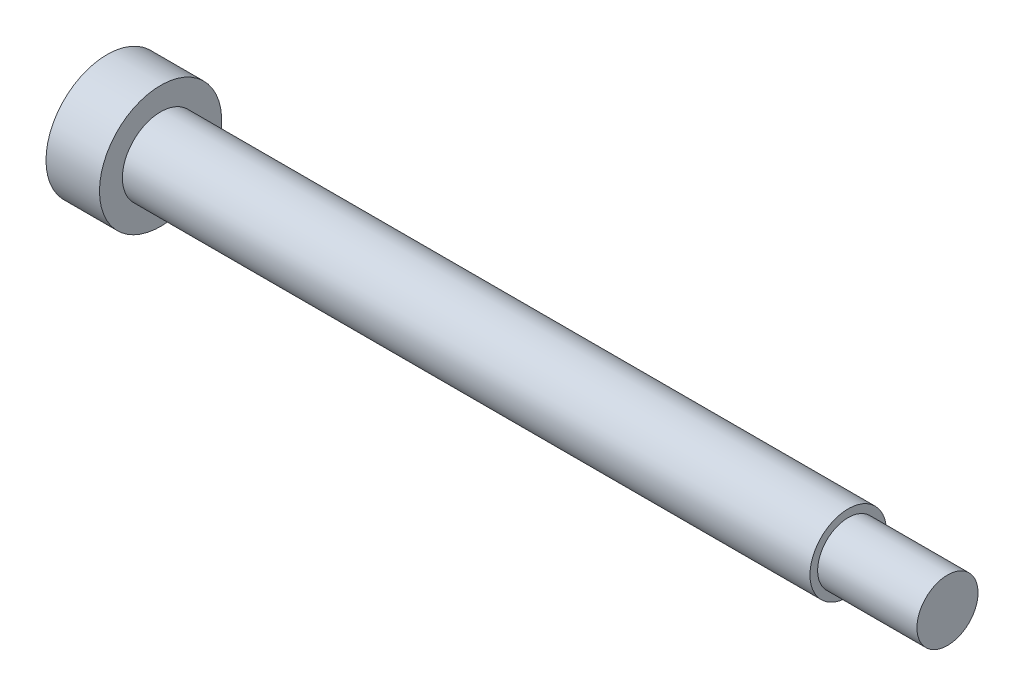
ISO-10303-21;
HEADER;
FILE_DESCRIPTION(('STEP AP214'),'2;1');
FILE_NAME('part.step','',(''),(''),'','','');
FILE_SCHEMA(('AUTOMOTIVE_DESIGN { 1 0 10303 214 1 1 1 1 }'));
ENDSEC;
DATA;
#1=APPLICATION_CONTEXT('core data for automotive mechanical design processes');
#2=APPLICATION_PROTOCOL_DEFINITION('international standard','automotive_design',2000,#1);
#3=PRODUCT_CONTEXT('',#1,'mechanical');
#4=PRODUCT('Part','Part','',(#3));
#5=PRODUCT_RELATED_PRODUCT_CATEGORY('part','',(#4));
#6=PRODUCT_DEFINITION_FORMATION('','',#4);
#7=PRODUCT_DEFINITION_CONTEXT('part definition',#1,'design');
#8=PRODUCT_DEFINITION('design','',#6,#7);
#9=PRODUCT_DEFINITION_SHAPE('','',#8);
#10=(LENGTH_UNIT() NAMED_UNIT(*) SI_UNIT(.MILLI.,.METRE.));
#11=(NAMED_UNIT(*) PLANE_ANGLE_UNIT() SI_UNIT($,.RADIAN.));
#12=(NAMED_UNIT(*) SI_UNIT($,.STERADIAN.) SOLID_ANGLE_UNIT());
#13=UNCERTAINTY_MEASURE_WITH_UNIT(LENGTH_MEASURE(1.E-05),#10,'distance_accuracy_value','');
#14=(GEOMETRIC_REPRESENTATION_CONTEXT(3) GLOBAL_UNCERTAINTY_ASSIGNED_CONTEXT((#13)) GLOBAL_UNIT_ASSIGNED_CONTEXT((#10,
#11,#12)) REPRESENTATION_CONTEXT('',''));
#15=CARTESIAN_POINT('',(0.,0.,0.));
#16=DIRECTION('',(0.,0.,1.));
#17=DIRECTION('',(1.,0.,0.));
#18=AXIS2_PLACEMENT_3D('',#15,#16,#17);
#19=CARTESIAN_POINT('',(0.,0.,0.));
#20=DIRECTION('',(1.,0.,0.));
#21=DIRECTION('',(0.,0.,-1.));
#22=AXIS2_PLACEMENT_3D('',#19,#20,#21);
#23=PLANE('',#22);
#24=DIRECTION('',(0.,0.866025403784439,-0.5));
#25=VECTOR('',#24,1.);
#26=CARTESIAN_POINT('',(0.,0.,2.5));
#27=LINE('',#26,#25);
#28=CARTESIAN_POINT('',(0.,0.,2.5));
#29=VERTEX_POINT('',#28);
#30=CARTESIAN_POINT('',(0.,2.1650635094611,1.25));
#31=VERTEX_POINT('',#30);
#32=EDGE_CURVE('E104',#29,#31,#27,.T.);
#33=ORIENTED_EDGE('',*,*,#32,.F.);
#34=DIRECTION('',(0.,0.866025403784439,0.5));
#35=VECTOR('',#34,1.);
#36=CARTESIAN_POINT('',(0.,-2.1650635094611,1.25));
#37=LINE('',#36,#35);
#38=CARTESIAN_POINT('',(0.,-2.1650635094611,1.25));
#39=VERTEX_POINT('',#38);
#40=EDGE_CURVE('E30',#39,#29,#37,.T.);
#41=ORIENTED_EDGE('',*,*,#40,.F.);
#42=DIRECTION('',(0.,0.,1.));
#43=VECTOR('',#42,1.);
#44=CARTESIAN_POINT('',(0.,-2.1650635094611,-1.25));
#45=LINE('',#44,#43);
#46=CARTESIAN_POINT('',(0.,-2.1650635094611,-1.25));
#47=VERTEX_POINT('',#46);
#48=EDGE_CURVE('E113',#47,#39,#45,.T.);
#49=ORIENTED_EDGE('',*,*,#48,.F.);
#50=DIRECTION('',(0.,-0.866025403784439,0.5));
#51=VECTOR('',#50,1.);
#52=CARTESIAN_POINT('',(0.,0.,-2.5));
#53=LINE('',#52,#51);
#54=CARTESIAN_POINT('',(0.,0.,-2.5));
#55=VERTEX_POINT('',#54);
#56=EDGE_CURVE('E111',#55,#47,#53,.T.);
#57=ORIENTED_EDGE('',*,*,#56,.F.);
#58=DIRECTION('',(0.,-0.866025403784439,-0.5));
#59=VECTOR('',#58,1.);
#60=CARTESIAN_POINT('',(0.,2.1650635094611,-1.25));
#61=LINE('',#60,#59);
#62=CARTESIAN_POINT('',(0.,2.1650635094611,-1.25));
#63=VERTEX_POINT('',#62);
#64=EDGE_CURVE('E78',#63,#55,#61,.T.);
#65=ORIENTED_EDGE('',*,*,#64,.F.);
#66=DIRECTION('',(0.,0.,-1.));
#67=VECTOR('',#66,1.);
#68=CARTESIAN_POINT('',(0.,2.1650635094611,1.25));
#69=LINE('',#68,#67);
#70=EDGE_CURVE('E107',#31,#63,#69,.T.);
#71=ORIENTED_EDGE('',*,*,#70,.F.);
#72=EDGE_LOOP('',(#33,#41,#49,#57,#65,#71));
#73=FACE_BOUND('',#72,.T.);
#74=CARTESIAN_POINT('',(0.,0.,0.));
#75=DIRECTION('',(-1.,0.,0.));
#76=DIRECTION('',(0.,0.,1.));
#77=AXIS2_PLACEMENT_3D('',#74,#75,#76);
#78=CIRCLE('',#77,8.);
#79=CARTESIAN_POINT('',(0.,0.,8.));
#80=VERTEX_POINT('',#79);
#81=EDGE_CURVE('E10',#80,#80,#78,.T.);
#82=ORIENTED_EDGE('',*,*,#81,.T.);
#83=EDGE_LOOP('',(#82));
#84=FACE_BOUND('',#83,.T.);
#85=ADVANCED_FACE('F16',(#73,#84),#23,.F.);
#86=CARTESIAN_POINT('',(0.,0.,0.));
#87=DIRECTION('',(-1.,0.,0.));
#88=DIRECTION('',(0.,0.,1.));
#89=AXIS2_PLACEMENT_3D('',#86,#87,#88);
#90=CYLINDRICAL_SURFACE('',#89,8.);
#91=ORIENTED_EDGE('',*,*,#81,.F.);
#92=EDGE_LOOP('',(#91));
#93=FACE_BOUND('',#92,.T.);
#94=CARTESIAN_POINT('',(7.,0.,0.));
#95=DIRECTION('',(-1.,0.,0.));
#96=DIRECTION('',(0.,0.,1.));
#97=AXIS2_PLACEMENT_3D('',#94,#95,#96);
#98=CIRCLE('',#97,8.);
#99=CARTESIAN_POINT('',(7.,0.,8.));
#100=VERTEX_POINT('',#99);
#101=EDGE_CURVE('E23',#100,#100,#98,.T.);
#102=ORIENTED_EDGE('',*,*,#101,.T.);
#103=EDGE_LOOP('',(#102));
#104=FACE_BOUND('',#103,.T.);
#105=ADVANCED_FACE('F136',(#93,#104),#90,.T.);
#106=CARTESIAN_POINT('',(7.,8.,0.));
#107=DIRECTION('',(-1.,0.,0.));
#108=DIRECTION('',(0.,0.,1.));
#109=AXIS2_PLACEMENT_3D('',#106,#107,#108);
#110=PLANE('',#109);
#111=ORIENTED_EDGE('',*,*,#101,.F.);
#112=EDGE_LOOP('',(#111));
#113=FACE_BOUND('',#112,.T.);
#114=CARTESIAN_POINT('',(7.,0.,0.));
#115=DIRECTION('',(-1.,0.,0.));
#116=DIRECTION('',(0.,0.,1.));
#117=AXIS2_PLACEMENT_3D('',#114,#115,#116);
#118=CIRCLE('',#117,5.);
#119=CARTESIAN_POINT('',(7.,0.,5.));
#120=VERTEX_POINT('',#119);
#121=EDGE_CURVE('E131',#120,#120,#118,.T.);
#122=ORIENTED_EDGE('',*,*,#121,.T.);
#123=EDGE_LOOP('',(#122));
#124=FACE_BOUND('',#123,.T.);
#125=ADVANCED_FACE('F138',(#113,#124),#110,.F.);
#126=CARTESIAN_POINT('',(0.,0.,0.));
#127=DIRECTION('',(-1.,0.,0.));
#128=DIRECTION('',(0.,0.,1.));
#129=AXIS2_PLACEMENT_3D('',#126,#127,#128);
#130=CYLINDRICAL_SURFACE('',#129,5.);
#131=ORIENTED_EDGE('',*,*,#121,.F.);
#132=EDGE_LOOP('',(#131));
#133=FACE_BOUND('',#132,.T.);
#134=CARTESIAN_POINT('',(97.,0.,0.));
#135=DIRECTION('',(-1.,0.,0.));
#136=DIRECTION('',(0.,0.,1.));
#137=AXIS2_PLACEMENT_3D('',#134,#135,#136);
#138=CIRCLE('',#137,5.);
#139=CARTESIAN_POINT('',(97.,0.,5.));
#140=VERTEX_POINT('',#139);
#141=EDGE_CURVE('E128',#140,#140,#138,.T.);
#142=ORIENTED_EDGE('',*,*,#141,.T.);
#143=EDGE_LOOP('',(#142));
#144=FACE_BOUND('',#143,.T.);
#145=ADVANCED_FACE('F141',(#133,#144),#130,.T.);
#146=CARTESIAN_POINT('',(97.,5.,0.));
#147=DIRECTION('',(-1.,0.,0.));
#148=DIRECTION('',(0.,0.,1.));
#149=AXIS2_PLACEMENT_3D('',#146,#147,#148);
#150=PLANE('',#149);
#151=ORIENTED_EDGE('',*,*,#141,.F.);
#152=EDGE_LOOP('',(#151));
#153=FACE_BOUND('',#152,.T.);
#154=CARTESIAN_POINT('',(97.,0.,0.));
#155=DIRECTION('',(-1.,0.,0.));
#156=DIRECTION('',(0.,0.,1.));
#157=AXIS2_PLACEMENT_3D('',#154,#155,#156);
#158=CIRCLE('',#157,4.);
#159=CARTESIAN_POINT('',(97.,0.,4.));
#160=VERTEX_POINT('',#159);
#161=EDGE_CURVE('E125',#160,#160,#158,.T.);
#162=ORIENTED_EDGE('',*,*,#161,.T.);
#163=EDGE_LOOP('',(#162));
#164=FACE_BOUND('',#163,.T.);
#165=ADVANCED_FACE('F147',(#153,#164),#150,.F.);
#166=CARTESIAN_POINT('',(0.,0.,0.));
#167=DIRECTION('',(-1.,0.,0.));
#168=DIRECTION('',(0.,0.,1.));
#169=AXIS2_PLACEMENT_3D('',#166,#167,#168);
#170=CYLINDRICAL_SURFACE('',#169,4.);
#171=ORIENTED_EDGE('',*,*,#161,.F.);
#172=EDGE_LOOP('',(#171));
#173=FACE_BOUND('',#172,.T.);
#174=CARTESIAN_POINT('',(110.,0.,0.));
#175=DIRECTION('',(-1.,0.,0.));
#176=DIRECTION('',(0.,0.,1.));
#177=AXIS2_PLACEMENT_3D('',#174,#175,#176);
#178=CIRCLE('',#177,4.);
#179=CARTESIAN_POINT('',(110.,0.,4.));
#180=VERTEX_POINT('',#179);
#181=EDGE_CURVE('E117',#180,#180,#178,.T.);
#182=ORIENTED_EDGE('',*,*,#181,.T.);
#183=EDGE_LOOP('',(#182));
#184=FACE_BOUND('',#183,.T.);
#185=ADVANCED_FACE('F153',(#173,#184),#170,.T.);
#186=CARTESIAN_POINT('',(110.,4.,0.));
#187=DIRECTION('',(-1.,0.,0.));
#188=DIRECTION('',(0.,0.,1.));
#189=AXIS2_PLACEMENT_3D('',#186,#187,#188);
#190=PLANE('',#189);
#191=ORIENTED_EDGE('',*,*,#181,.F.);
#192=EDGE_LOOP('',(#191));
#193=FACE_BOUND('',#192,.T.);
#194=ADVANCED_FACE('F159',(#193),#190,.F.);
#195=CARTESIAN_POINT('',(5.,-2.1650635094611,1.25));
#196=DIRECTION('',(0.,-0.5,0.866025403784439));
#197=DIRECTION('',(0.,-0.866025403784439,-0.5));
#198=AXIS2_PLACEMENT_3D('',#195,#196,#197);
#199=PLANE('',#198);
#200=ORIENTED_EDGE('',*,*,#40,.T.);
#201=DIRECTION('',(-1.,0.,0.));
#202=VECTOR('',#201,1.);
#203=CARTESIAN_POINT('',(5.,0.,2.5));
#204=LINE('',#203,#202);
#205=CARTESIAN_POINT('',(5.,0.,2.5));
#206=VERTEX_POINT('',#205);
#207=EDGE_CURVE('E60',#206,#29,#204,.T.);
#208=ORIENTED_EDGE('',*,*,#207,.F.);
#209=DIRECTION('',(0.,0.866025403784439,0.5));
#210=VECTOR('',#209,1.);
#211=CARTESIAN_POINT('',(5.,-2.1650635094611,1.25));
#212=LINE('',#211,#210);
#213=CARTESIAN_POINT('',(5.,-2.1650635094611,1.25));
#214=VERTEX_POINT('',#213);
#215=EDGE_CURVE('E115',#214,#206,#212,.T.);
#216=ORIENTED_EDGE('',*,*,#215,.F.);
#217=DIRECTION('',(-1.,0.,0.));
#218=VECTOR('',#217,1.);
#219=CARTESIAN_POINT('',(5.,-2.1650635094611,1.25));
#220=LINE('',#219,#218);
#221=EDGE_CURVE('E38',#214,#39,#220,.T.);
#222=ORIENTED_EDGE('',*,*,#221,.T.);
#223=EDGE_LOOP('',(#200,#208,#216,#222));
#224=FACE_BOUND('',#223,.T.);
#225=ADVANCED_FACE('F164',(#224),#199,.F.);
#226=CARTESIAN_POINT('',(5.,-2.1650635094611,-1.25));
#227=DIRECTION('',(0.,-1.,0.));
#228=DIRECTION('',(0.,0.,-1.));
#229=AXIS2_PLACEMENT_3D('',#226,#227,#228);
#230=PLANE('',#229);
#231=ORIENTED_EDGE('',*,*,#48,.T.);
#232=ORIENTED_EDGE('',*,*,#221,.F.);
#233=DIRECTION('',(0.,0.,1.));
#234=VECTOR('',#233,1.);
#235=CARTESIAN_POINT('',(5.,-2.1650635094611,-1.25));
#236=LINE('',#235,#234);
#237=CARTESIAN_POINT('',(5.,-2.1650635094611,-1.25));
#238=VERTEX_POINT('',#237);
#239=EDGE_CURVE('E90',#238,#214,#236,.T.);
#240=ORIENTED_EDGE('',*,*,#239,.F.);
#241=DIRECTION('',(-1.,0.,0.));
#242=VECTOR('',#241,1.);
#243=CARTESIAN_POINT('',(5.,-2.1650635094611,-1.25));
#244=LINE('',#243,#242);
#245=EDGE_CURVE('E82',#238,#47,#244,.T.);
#246=ORIENTED_EDGE('',*,*,#245,.T.);
#247=EDGE_LOOP('',(#231,#232,#240,#246));
#248=FACE_BOUND('',#247,.T.);
#249=ADVANCED_FACE('F171',(#248),#230,.F.);
#250=CARTESIAN_POINT('',(5.,0.,-2.5));
#251=DIRECTION('',(0.,-0.5,-0.866025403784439));
#252=DIRECTION('',(0.,0.866025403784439,-0.5));
#253=AXIS2_PLACEMENT_3D('',#250,#251,#252);
#254=PLANE('',#253);
#255=ORIENTED_EDGE('',*,*,#56,.T.);
#256=ORIENTED_EDGE('',*,*,#245,.F.);
#257=DIRECTION('',(0.,-0.866025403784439,0.5));
#258=VECTOR('',#257,1.);
#259=CARTESIAN_POINT('',(5.,0.,-2.5));
#260=LINE('',#259,#258);
#261=CARTESIAN_POINT('',(5.,0.,-2.5));
#262=VERTEX_POINT('',#261);
#263=EDGE_CURVE('E86',#262,#238,#260,.T.);
#264=ORIENTED_EDGE('',*,*,#263,.F.);
#265=DIRECTION('',(-1.,0.,0.));
#266=VECTOR('',#265,1.);
#267=CARTESIAN_POINT('',(5.,0.,-2.5));
#268=LINE('',#267,#266);
#269=EDGE_CURVE('E71',#262,#55,#268,.T.);
#270=ORIENTED_EDGE('',*,*,#269,.T.);
#271=EDGE_LOOP('',(#255,#256,#264,#270));
#272=FACE_BOUND('',#271,.T.);
#273=ADVANCED_FACE('F87',(#272),#254,.F.);
#274=CARTESIAN_POINT('',(5.,2.1650635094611,-1.25));
#275=DIRECTION('',(0.,0.5,-0.866025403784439));
#276=DIRECTION('',(0.,0.866025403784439,0.5));
#277=AXIS2_PLACEMENT_3D('',#274,#275,#276);
#278=PLANE('',#277);
#279=ORIENTED_EDGE('',*,*,#64,.T.);
#280=ORIENTED_EDGE('',*,*,#269,.F.);
#281=DIRECTION('',(0.,-0.866025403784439,-0.5));
#282=VECTOR('',#281,1.);
#283=CARTESIAN_POINT('',(5.,2.1650635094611,-1.25));
#284=LINE('',#283,#282);
#285=CARTESIAN_POINT('',(5.,2.1650635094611,-1.25));
#286=VERTEX_POINT('',#285);
#287=EDGE_CURVE('E75',#286,#262,#284,.T.);
#288=ORIENTED_EDGE('',*,*,#287,.F.);
#289=DIRECTION('',(-1.,0.,0.));
#290=VECTOR('',#289,1.);
#291=CARTESIAN_POINT('',(5.,2.1650635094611,-1.25));
#292=LINE('',#291,#290);
#293=EDGE_CURVE('E83',#286,#63,#292,.T.);
#294=ORIENTED_EDGE('',*,*,#293,.T.);
#295=EDGE_LOOP('',(#279,#280,#288,#294));
#296=FACE_BOUND('',#295,.T.);
#297=ADVANCED_FACE('F73',(#296),#278,.F.);
#298=CARTESIAN_POINT('',(5.,2.1650635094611,1.25));
#299=DIRECTION('',(0.,1.,0.));
#300=DIRECTION('',(0.,0.,1.));
#301=AXIS2_PLACEMENT_3D('',#298,#299,#300);
#302=PLANE('',#301);
#303=ORIENTED_EDGE('',*,*,#70,.T.);
#304=ORIENTED_EDGE('',*,*,#293,.F.);
#305=DIRECTION('',(0.,0.,-1.));
#306=VECTOR('',#305,1.);
#307=CARTESIAN_POINT('',(5.,2.1650635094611,1.25));
#308=LINE('',#307,#306);
#309=CARTESIAN_POINT('',(5.,2.1650635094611,1.25));
#310=VERTEX_POINT('',#309);
#311=EDGE_CURVE('E96',#310,#286,#308,.T.);
#312=ORIENTED_EDGE('',*,*,#311,.F.);
#313=DIRECTION('',(-1.,0.,0.));
#314=VECTOR('',#313,1.);
#315=CARTESIAN_POINT('',(5.,2.1650635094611,1.25));
#316=LINE('',#315,#314);
#317=EDGE_CURVE('E120',#310,#31,#316,.T.);
#318=ORIENTED_EDGE('',*,*,#317,.T.);
#319=EDGE_LOOP('',(#303,#304,#312,#318));
#320=FACE_BOUND('',#319,.T.);
#321=ADVANCED_FACE('F199',(#320),#302,.F.);
#322=CARTESIAN_POINT('',(5.,0.,2.5));
#323=DIRECTION('',(0.,0.5,0.866025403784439));
#324=DIRECTION('',(0.,-0.866025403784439,0.5));
#325=AXIS2_PLACEMENT_3D('',#322,#323,#324);
#326=PLANE('',#325);
#327=ORIENTED_EDGE('',*,*,#32,.T.);
#328=ORIENTED_EDGE('',*,*,#317,.F.);
#329=DIRECTION('',(0.,0.866025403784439,-0.5));
#330=VECTOR('',#329,1.);
#331=CARTESIAN_POINT('',(5.,0.,2.5));
#332=LINE('',#331,#330);
#333=EDGE_CURVE('E98',#206,#310,#332,.T.);
#334=ORIENTED_EDGE('',*,*,#333,.F.);
#335=ORIENTED_EDGE('',*,*,#207,.T.);
#336=EDGE_LOOP('',(#327,#328,#334,#335));
#337=FACE_BOUND('',#336,.T.);
#338=ADVANCED_FACE('F186',(#337),#326,.F.);
#339=CARTESIAN_POINT('',(5.,0.,0.));
#340=DIRECTION('',(-1.,0.,0.));
#341=DIRECTION('',(0.,0.,1.));
#342=AXIS2_PLACEMENT_3D('',#339,#340,#341);
#343=PLANE('',#342);
#344=ORIENTED_EDGE('',*,*,#215,.T.);
#345=ORIENTED_EDGE('',*,*,#333,.T.);
#346=ORIENTED_EDGE('',*,*,#311,.T.);
#347=ORIENTED_EDGE('',*,*,#287,.T.);
#348=ORIENTED_EDGE('',*,*,#263,.T.);
#349=ORIENTED_EDGE('',*,*,#239,.T.);
#350=EDGE_LOOP('',(#344,#345,#346,#347,#348,#349));
#351=FACE_BOUND('',#350,.T.);
#352=ADVANCED_FACE('F93',(#351),#343,.T.);
#353=CLOSED_SHELL('',(#85,#105,#125,#145,#165,#185,#194,#225,#249,#273,#297,#321,#338,#352));
#354=MANIFOLD_SOLID_BREP('B1',#353);
#355=ADVANCED_BREP_SHAPE_REPRESENTATION('',(#18,#354),#14);
#356=SHAPE_DEFINITION_REPRESENTATION(#9,#355);
ENDSEC;
END-ISO-10303-21;
